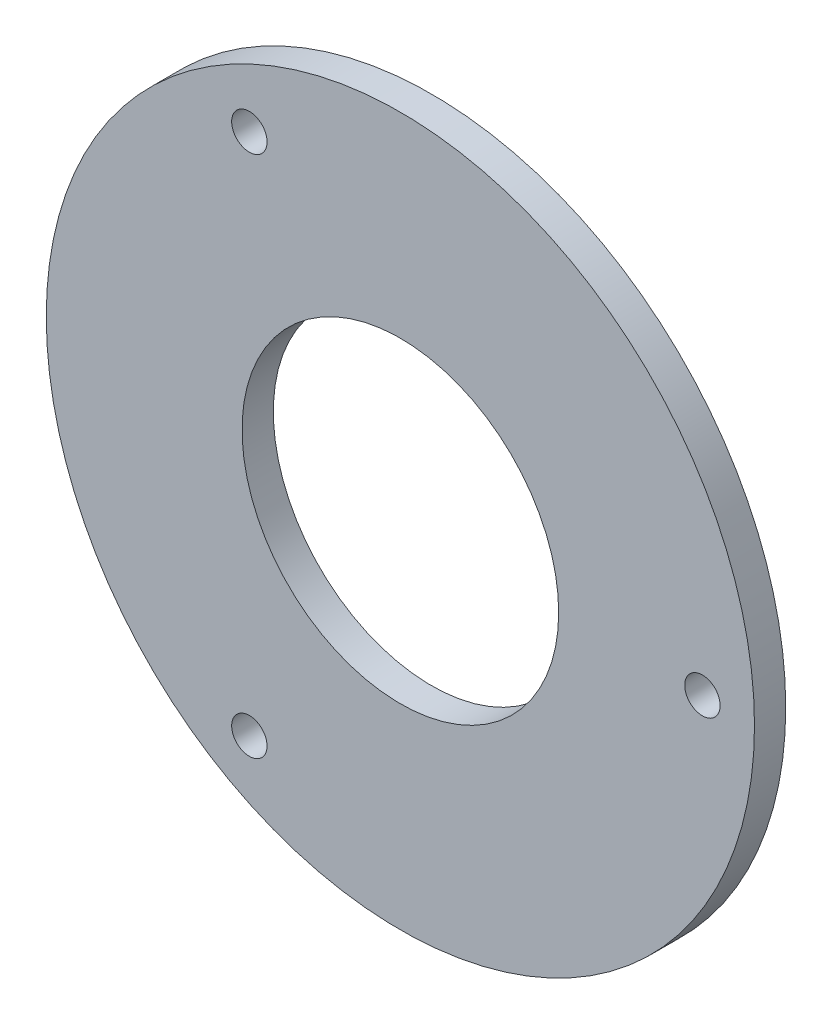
ISO-10303-21;
HEADER;
FILE_DESCRIPTION(('STEP AP214'),'2;1');
FILE_NAME('part.step','',(''),(''),'','','');
FILE_SCHEMA(('AUTOMOTIVE_DESIGN { 1 0 10303 214 1 1 1 1 }'));
ENDSEC;
DATA;
#1=APPLICATION_CONTEXT('core data for automotive mechanical design processes');
#2=APPLICATION_PROTOCOL_DEFINITION('international standard','automotive_design',2000,#1);
#3=PRODUCT_CONTEXT('',#1,'mechanical');
#4=PRODUCT('Part','Part','',(#3));
#5=PRODUCT_RELATED_PRODUCT_CATEGORY('part','',(#4));
#6=PRODUCT_DEFINITION_FORMATION('','',#4);
#7=PRODUCT_DEFINITION_CONTEXT('part definition',#1,'design');
#8=PRODUCT_DEFINITION('design','',#6,#7);
#9=PRODUCT_DEFINITION_SHAPE('','',#8);
#10=(LENGTH_UNIT() NAMED_UNIT(*) SI_UNIT(.MILLI.,.METRE.));
#11=(NAMED_UNIT(*) PLANE_ANGLE_UNIT() SI_UNIT($,.RADIAN.));
#12=(NAMED_UNIT(*) SI_UNIT($,.STERADIAN.) SOLID_ANGLE_UNIT());
#13=UNCERTAINTY_MEASURE_WITH_UNIT(LENGTH_MEASURE(1.E-05),#10,'distance_accuracy_value','');
#14=(GEOMETRIC_REPRESENTATION_CONTEXT(3) GLOBAL_UNCERTAINTY_ASSIGNED_CONTEXT((#13)) GLOBAL_UNIT_ASSIGNED_CONTEXT((#10,
#11,#12)) REPRESENTATION_CONTEXT('',''));
#15=CARTESIAN_POINT('',(0.,0.,0.));
#16=DIRECTION('',(0.,0.,1.));
#17=DIRECTION('',(1.,0.,0.));
#18=AXIS2_PLACEMENT_3D('',#15,#16,#17);
#19=CARTESIAN_POINT('',(-14.5,25.114736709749,0.));
#20=DIRECTION('',(0.,0.,-1.));
#21=DIRECTION('',(1.,0.,0.));
#22=AXIS2_PLACEMENT_3D('',#19,#20,#21);
#23=CYLINDRICAL_SURFACE('',#22,1.7);
#24=CARTESIAN_POINT('',(-14.5,25.114736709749,3.));
#25=DIRECTION('',(0.,0.,1.));
#26=DIRECTION('',(1.,0.,0.));
#27=AXIS2_PLACEMENT_3D('',#24,#25,#26);
#28=CIRCLE('',#27,1.7);
#29=CARTESIAN_POINT('',(-12.8,25.114736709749,3.));
#30=VERTEX_POINT('',#29);
#31=EDGE_CURVE('E9',#30,#30,#28,.T.);
#32=ORIENTED_EDGE('',*,*,#31,.T.);
#33=EDGE_LOOP('',(#32));
#34=FACE_BOUND('',#33,.T.);
#35=CARTESIAN_POINT('',(-14.5,25.114736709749,0.));
#36=DIRECTION('',(0.,0.,1.));
#37=DIRECTION('',(1.,0.,0.));
#38=AXIS2_PLACEMENT_3D('',#35,#36,#37);
#39=CIRCLE('',#38,1.7);
#40=CARTESIAN_POINT('',(-12.8,25.114736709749,0.));
#41=VERTEX_POINT('',#40);
#42=EDGE_CURVE('E33',#41,#41,#39,.T.);
#43=ORIENTED_EDGE('',*,*,#42,.F.);
#44=EDGE_LOOP('',(#43));
#45=FACE_BOUND('',#44,.T.);
#46=ADVANCED_FACE('F14',(#34,#45),#23,.F.);
#47=CARTESIAN_POINT('',(1.621709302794E-13,0.,0.));
#48=DIRECTION('',(0.,0.,-1.));
#49=DIRECTION('',(1.,0.,0.));
#50=AXIS2_PLACEMENT_3D('',#47,#48,#49);
#51=CYLINDRICAL_SURFACE('',#50,15.2);
#52=CARTESIAN_POINT('',(1.621709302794E-13,0.,3.));
#53=DIRECTION('',(0.,0.,1.));
#54=DIRECTION('',(1.,0.,0.));
#55=AXIS2_PLACEMENT_3D('',#52,#53,#54);
#56=CIRCLE('',#55,15.2);
#57=CARTESIAN_POINT('',(15.2000000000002,0.,3.));
#58=VERTEX_POINT('',#57);
#59=EDGE_CURVE('E17',#58,#58,#56,.T.);
#60=ORIENTED_EDGE('',*,*,#59,.T.);
#61=EDGE_LOOP('',(#60));
#62=FACE_BOUND('',#61,.T.);
#63=CARTESIAN_POINT('',(1.621709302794E-13,0.,0.));
#64=DIRECTION('',(0.,0.,1.));
#65=DIRECTION('',(1.,0.,0.));
#66=AXIS2_PLACEMENT_3D('',#63,#64,#65);
#67=CIRCLE('',#66,15.2);
#68=CARTESIAN_POINT('',(15.2000000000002,0.,0.));
#69=VERTEX_POINT('',#68);
#70=EDGE_CURVE('E34',#69,#69,#67,.T.);
#71=ORIENTED_EDGE('',*,*,#70,.F.);
#72=EDGE_LOOP('',(#71));
#73=FACE_BOUND('',#72,.T.);
#74=ADVANCED_FACE('F93',(#62,#73),#51,.F.);
#75=CARTESIAN_POINT('',(29.,0.,0.));
#76=DIRECTION('',(0.,0.,-1.));
#77=DIRECTION('',(1.,0.,0.));
#78=AXIS2_PLACEMENT_3D('',#75,#76,#77);
#79=CYLINDRICAL_SURFACE('',#78,1.7);
#80=CARTESIAN_POINT('',(29.,0.,3.));
#81=DIRECTION('',(0.,0.,1.));
#82=DIRECTION('',(1.,0.,0.));
#83=AXIS2_PLACEMENT_3D('',#80,#81,#82);
#84=CIRCLE('',#83,1.7);
#85=CARTESIAN_POINT('',(30.7,0.,3.));
#86=VERTEX_POINT('',#85);
#87=EDGE_CURVE('E26',#86,#86,#84,.T.);
#88=ORIENTED_EDGE('',*,*,#87,.T.);
#89=EDGE_LOOP('',(#88));
#90=FACE_BOUND('',#89,.T.);
#91=CARTESIAN_POINT('',(29.,0.,0.));
#92=DIRECTION('',(0.,0.,1.));
#93=DIRECTION('',(1.,0.,0.));
#94=AXIS2_PLACEMENT_3D('',#91,#92,#93);
#95=CIRCLE('',#94,1.7);
#96=CARTESIAN_POINT('',(30.7,0.,0.));
#97=VERTEX_POINT('',#96);
#98=EDGE_CURVE('E39',#97,#97,#95,.T.);
#99=ORIENTED_EDGE('',*,*,#98,.F.);
#100=EDGE_LOOP('',(#99));
#101=FACE_BOUND('',#100,.T.);
#102=ADVANCED_FACE('F64',(#90,#101),#79,.F.);
#103=CARTESIAN_POINT('',(-14.5,-25.11473670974,0.));
#104=DIRECTION('',(0.,0.,-1.));
#105=DIRECTION('',(1.,0.,0.));
#106=AXIS2_PLACEMENT_3D('',#103,#104,#105);
#107=CYLINDRICAL_SURFACE('',#106,1.7);
#108=CARTESIAN_POINT('',(-14.5,-25.11473670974,3.));
#109=DIRECTION('',(0.,0.,1.));
#110=DIRECTION('',(1.,0.,0.));
#111=AXIS2_PLACEMENT_3D('',#108,#109,#110);
#112=CIRCLE('',#111,1.7);
#113=CARTESIAN_POINT('',(-12.8,-25.11473670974,3.));
#114=VERTEX_POINT('',#113);
#115=EDGE_CURVE('E35',#114,#114,#112,.T.);
#116=ORIENTED_EDGE('',*,*,#115,.T.);
#117=EDGE_LOOP('',(#116));
#118=FACE_BOUND('',#117,.T.);
#119=CARTESIAN_POINT('',(-14.5,-25.11473670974,0.));
#120=DIRECTION('',(0.,0.,1.));
#121=DIRECTION('',(1.,0.,0.));
#122=AXIS2_PLACEMENT_3D('',#119,#120,#121);
#123=CIRCLE('',#122,1.7);
#124=CARTESIAN_POINT('',(-12.8,-25.11473670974,0.));
#125=VERTEX_POINT('',#124);
#126=EDGE_CURVE('E43',#125,#125,#123,.T.);
#127=ORIENTED_EDGE('',*,*,#126,.F.);
#128=EDGE_LOOP('',(#127));
#129=FACE_BOUND('',#128,.T.);
#130=ADVANCED_FACE('F68',(#118,#129),#107,.F.);
#131=CARTESIAN_POINT('',(0.,0.,3.));
#132=DIRECTION('',(0.,0.,1.));
#133=DIRECTION('',(1.,0.,0.));
#134=AXIS2_PLACEMENT_3D('',#131,#132,#133);
#135=PLANE('',#134);
#136=ORIENTED_EDGE('',*,*,#31,.F.);
#137=EDGE_LOOP('',(#136));
#138=FACE_BOUND('',#137,.T.);
#139=ORIENTED_EDGE('',*,*,#59,.F.);
#140=EDGE_LOOP('',(#139));
#141=FACE_BOUND('',#140,.T.);
#142=ORIENTED_EDGE('',*,*,#87,.F.);
#143=EDGE_LOOP('',(#142));
#144=FACE_BOUND('',#143,.T.);
#145=ORIENTED_EDGE('',*,*,#115,.F.);
#146=EDGE_LOOP('',(#145));
#147=FACE_BOUND('',#146,.T.);
#148=CARTESIAN_POINT('',(0.,0.,3.));
#149=DIRECTION('',(0.,0.,1.));
#150=DIRECTION('',(1.,0.,0.));
#151=AXIS2_PLACEMENT_3D('',#148,#149,#150);
#152=CIRCLE('',#151,34.);
#153=CARTESIAN_POINT('',(34.,0.,3.));
#154=VERTEX_POINT('',#153);
#155=EDGE_CURVE('E50',#154,#154,#152,.T.);
#156=ORIENTED_EDGE('',*,*,#155,.T.);
#157=EDGE_LOOP('',(#156));
#158=FACE_BOUND('',#157,.T.);
#159=ADVANCED_FACE('F67',(#138,#141,#144,#147,#158),#135,.T.);
#160=CARTESIAN_POINT('',(0.,0.,0.));
#161=DIRECTION('',(0.,0.,1.));
#162=DIRECTION('',(1.,0.,0.));
#163=AXIS2_PLACEMENT_3D('',#160,#161,#162);
#164=PLANE('',#163);
#165=ORIENTED_EDGE('',*,*,#42,.T.);
#166=EDGE_LOOP('',(#165));
#167=FACE_BOUND('',#166,.T.);
#168=ORIENTED_EDGE('',*,*,#70,.T.);
#169=EDGE_LOOP('',(#168));
#170=FACE_BOUND('',#169,.T.);
#171=ORIENTED_EDGE('',*,*,#98,.T.);
#172=EDGE_LOOP('',(#171));
#173=FACE_BOUND('',#172,.T.);
#174=ORIENTED_EDGE('',*,*,#126,.T.);
#175=EDGE_LOOP('',(#174));
#176=FACE_BOUND('',#175,.T.);
#177=CARTESIAN_POINT('',(0.,0.,0.));
#178=DIRECTION('',(0.,0.,1.));
#179=DIRECTION('',(1.,0.,0.));
#180=AXIS2_PLACEMENT_3D('',#177,#178,#179);
#181=CIRCLE('',#180,34.);
#182=CARTESIAN_POINT('',(34.,0.,0.));
#183=VERTEX_POINT('',#182);
#184=EDGE_CURVE('E51',#183,#183,#181,.T.);
#185=ORIENTED_EDGE('',*,*,#184,.F.);
#186=EDGE_LOOP('',(#185));
#187=FACE_BOUND('',#186,.T.);
#188=ADVANCED_FACE('F66',(#167,#170,#173,#176,#187),#164,.F.);
#189=CARTESIAN_POINT('',(0.,0.,0.));
#190=DIRECTION('',(0.,0.,-1.));
#191=DIRECTION('',(1.,0.,0.));
#192=AXIS2_PLACEMENT_3D('',#189,#190,#191);
#193=CYLINDRICAL_SURFACE('',#192,34.);
#194=ORIENTED_EDGE('',*,*,#155,.F.);
#195=EDGE_LOOP('',(#194));
#196=FACE_BOUND('',#195,.T.);
#197=ORIENTED_EDGE('',*,*,#184,.T.);
#198=EDGE_LOOP('',(#197));
#199=FACE_BOUND('',#198,.T.);
#200=ADVANCED_FACE('F80',(#196,#199),#193,.T.);
#201=CLOSED_SHELL('',(#46,#74,#102,#130,#159,#188,#200));
#202=MANIFOLD_SOLID_BREP('B1',#201);
#203=ADVANCED_BREP_SHAPE_REPRESENTATION('',(#18,#202),#14);
#204=SHAPE_DEFINITION_REPRESENTATION(#9,#203);
ENDSEC;
END-ISO-10303-21;
